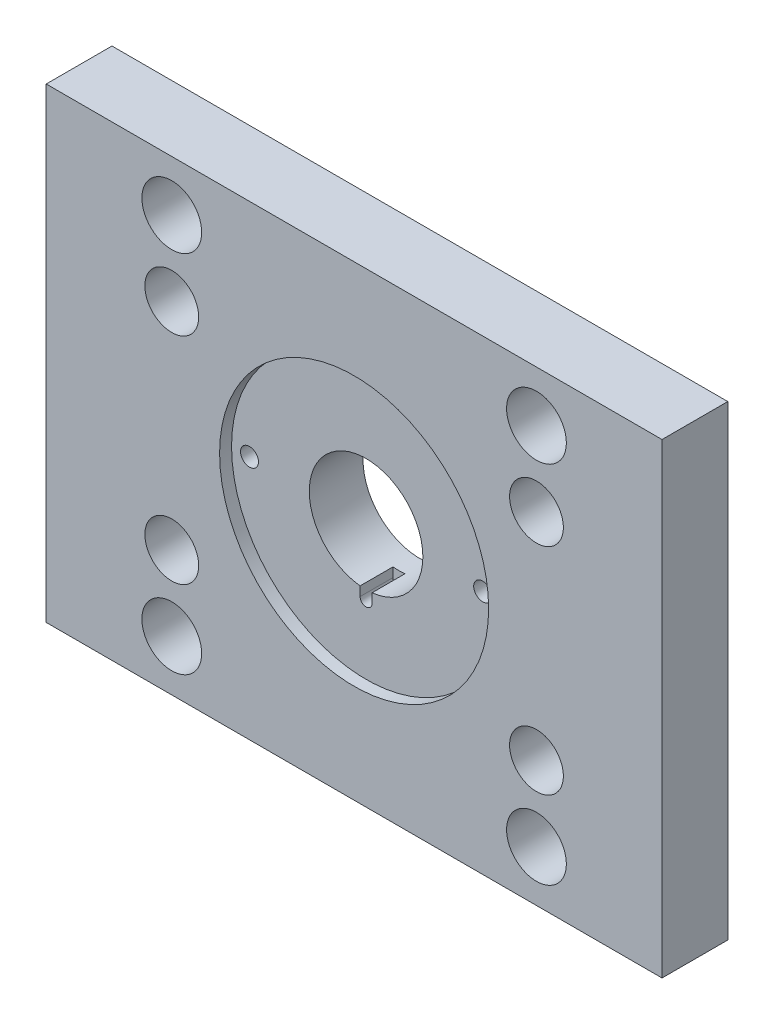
from build123d import *

# Parameters (mm, degrees)
ESQUISSE1_W                     = 206
ESQUISSE1_H                     = 156
EXTRUSION1_DEPTH                = 22
ESQUISSE5_R                     = 10
ENL_V_MAT_EXTRU_3_DEPTH         = 132.061054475
R_P_TITION_LIN_AIRE3_COUNT      = 2
R_P_TITION_LIN_AIRE3_PITCH      = 122
R_P_TITION_LIN_AIRE3_COUNT_DIR2 = 2
R_P_TITION_LIN_AIRE3_PITCH_DIR2 = 122
ESQUISSE7_R                     = 5
ENL_V_MAT_EXTRU_4_DEPTH         = 132.061054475
ESQUISSE8_R                     = 9
ENL_V_MAT_EXTRU_5_DEPTH         = 13
R_P_TITION_LIN_AIRE1_COUNT      = 2
R_P_TITION_LIN_AIRE1_PITCH      = 122
R_P_TITION_LIN_AIRE1_COUNT_DIR2 = 2
R_P_TITION_LIN_AIRE1_PITCH_DIR2 = 72
ESQUISSE9_R                     = 19
ENL_V_MAT_EXTRU_6_DEPTH         = 132.061054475
ESQUISSE11_R                    = 45
ENL_V_MAT_EXTRU_7_DEPTH         = 4
ESQUISSE12_R                    = 3
ENL_V_MAT_EXTRU_8_DEPTH         = 20
R_P_TITION_LIN_AIRE2_COUNT      = 2
R_P_TITION_LIN_AIRE2_PITCH      = 78
ENL_V_MAT_EXTRU_9_DEPTH         = 11


with BuildPart() as part:
    # Esquisse1 → Extrusion1 (new body)
    with BuildSketch(Plane.XY):
        Rectangle(ESQUISSE1_W, ESQUISSE1_H)
    extrude(amount=EXTRUSION1_DEPTH)

    # Esquisse5 → Enl_v. mat.-Extru.3 (cut, through all)
    with BuildSketch(Plane.XY.offset(22)):
        with Locations((-61, 61)):
            Circle(ESQUISSE5_R)
    enl_v_mat_extru_3 = extrude(amount=-ENL_V_MAT_EXTRU_3_DEPTH, mode=Mode.SUBTRACT)

    # R_p_tition lin_aire3: Enl_v. mat.-Extru.3 2 × 2
    with Locations(*[(i * R_P_TITION_LIN_AIRE3_PITCH, -j * R_P_TITION_LIN_AIRE3_PITCH_DIR2, 0) for i in range(R_P_TITION_LIN_AIRE3_COUNT) for j in range(R_P_TITION_LIN_AIRE3_COUNT_DIR2) if (i, j) != (0, 0)]):
        add(enl_v_mat_extru_3, mode=Mode.SUBTRACT)

    # Esquisse7 → Enl_v. mat.-Extru.4 (cut, through all)
    with BuildSketch(Plane.XY.offset(22)):
        with Locations((-61, 36)):
            Circle(ESQUISSE7_R)
    enl_v_mat_extru_4 = extrude(amount=-ENL_V_MAT_EXTRU_4_DEPTH, mode=Mode.SUBTRACT)

    # Esquisse8 → Enl_v. mat.-Extru.5 (cut)
    with BuildSketch(Plane.XY.offset(22)):
        with Locations((-61, 36)):
            Circle(ESQUISSE8_R)
    enl_v_mat_extru_5 = extrude(amount=-ENL_V_MAT_EXTRU_5_DEPTH, mode=Mode.SUBTRACT)

    # R_p_tition lin_aire1: Enl_v. mat.-Extru.4, Enl_v. mat.-Extru.5 2 × 2
    with Locations(*[(i * R_P_TITION_LIN_AIRE1_PITCH, -j * R_P_TITION_LIN_AIRE1_PITCH_DIR2, 0) for i in range(R_P_TITION_LIN_AIRE1_COUNT) for j in range(R_P_TITION_LIN_AIRE1_COUNT_DIR2) if (i, j) != (0, 0)]):
        add(enl_v_mat_extru_4, mode=Mode.SUBTRACT)
        add(enl_v_mat_extru_5, mode=Mode.SUBTRACT)

    # Esquisse9 → Enl_v. mat.-Extru.6 (cut, through all)
    with BuildSketch(Plane.XY.offset(22)):
        Circle(ESQUISSE9_R)
    extrude(amount=-ENL_V_MAT_EXTRU_6_DEPTH, mode=Mode.SUBTRACT)

    # Esquisse11 → Enl_v. mat.-Extru.7 (cut)
    with BuildSketch(Plane.XY.offset(22)):
        Circle(ESQUISSE11_R)
    extrude(amount=-ENL_V_MAT_EXTRU_7_DEPTH, mode=Mode.SUBTRACT)

    # Esquisse12 → Enl_v. mat.-Extru.8 (cut)
    with BuildSketch(Plane.XY.offset(18)):
        with Locations((-39, 0)):
            Circle(ESQUISSE12_R)
    enl_v_mat_extru_8 = extrude(amount=-ENL_V_MAT_EXTRU_8_DEPTH, mode=Mode.SUBTRACT)

    # R_p_tition lin_aire2: Enl_v. mat.-Extru.8 ×2
    with Locations(*[(i * R_P_TITION_LIN_AIRE2_PITCH, 0, 0) for i in range(1, R_P_TITION_LIN_AIRE2_COUNT)]):
        add(enl_v_mat_extru_8, mode=Mode.SUBTRACT)

    # Esquisse13 → Enl_v. mat.-Extru.9 (cut)
    with BuildSketch(Plane.XY.offset(18)):
        with BuildLine():
            Line((-2, -18), (2, -18))
            Line((2, -18), (2, -22))
            ThreePointArc((2, -22), (0, -24), (-2, -22))
            Line((-2, -22), (-2, -18))
        make_face()
    extrude(amount=-ENL_V_MAT_EXTRU_9_DEPTH, mode=Mode.SUBTRACT)


solid = part.part
